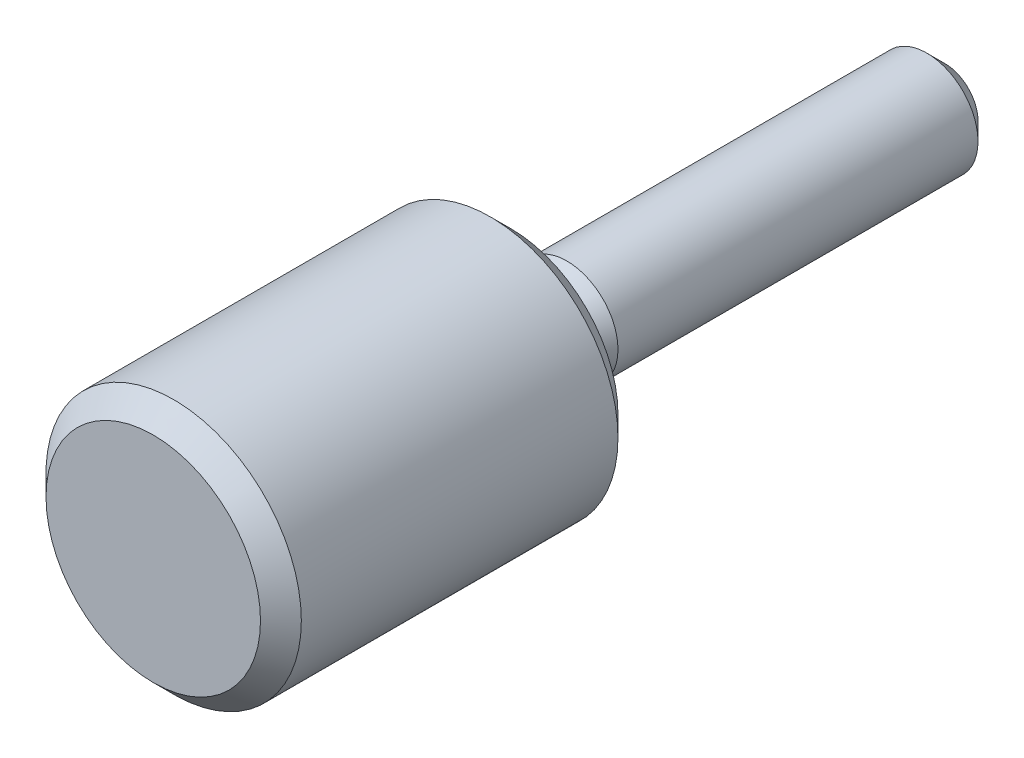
ISO-10303-21;
HEADER;
FILE_DESCRIPTION(('STEP AP214'),'2;1');
FILE_NAME('part.step','',(''),(''),'','','');
FILE_SCHEMA(('AUTOMOTIVE_DESIGN { 1 0 10303 214 1 1 1 1 }'));
ENDSEC;
DATA;
#1=APPLICATION_CONTEXT('core data for automotive mechanical design processes');
#2=APPLICATION_PROTOCOL_DEFINITION('international standard','automotive_design',2000,#1);
#3=PRODUCT_CONTEXT('',#1,'mechanical');
#4=PRODUCT('Part','Part','',(#3));
#5=PRODUCT_RELATED_PRODUCT_CATEGORY('part','',(#4));
#6=PRODUCT_DEFINITION_FORMATION('','',#4);
#7=PRODUCT_DEFINITION_CONTEXT('part definition',#1,'design');
#8=PRODUCT_DEFINITION('design','',#6,#7);
#9=PRODUCT_DEFINITION_SHAPE('','',#8);
#10=(LENGTH_UNIT() NAMED_UNIT(*) SI_UNIT(.MILLI.,.METRE.));
#11=(NAMED_UNIT(*) PLANE_ANGLE_UNIT() SI_UNIT($,.RADIAN.));
#12=(NAMED_UNIT(*) SI_UNIT($,.STERADIAN.) SOLID_ANGLE_UNIT());
#13=UNCERTAINTY_MEASURE_WITH_UNIT(LENGTH_MEASURE(1.E-05),#10,'distance_accuracy_value','');
#14=(GEOMETRIC_REPRESENTATION_CONTEXT(3) GLOBAL_UNCERTAINTY_ASSIGNED_CONTEXT((#13)) GLOBAL_UNIT_ASSIGNED_CONTEXT((#10,
#11,#12)) REPRESENTATION_CONTEXT('',''));
#15=CARTESIAN_POINT('',(0.,0.,0.));
#16=DIRECTION('',(0.,0.,1.));
#17=DIRECTION('',(1.,0.,0.));
#18=AXIS2_PLACEMENT_3D('',#15,#16,#17);
#19=CARTESIAN_POINT('',(0.,0.,14.));
#20=DIRECTION('',(0.,0.,-1.));
#21=DIRECTION('',(-1.,0.,0.));
#22=AXIS2_PLACEMENT_3D('',#19,#20,#21);
#23=CYLINDRICAL_SURFACE('',#22,5.);
#24=CARTESIAN_POINT('',(0.,0.,13.2));
#25=DIRECTION('',(0.,0.,1.));
#26=DIRECTION('',(1.,0.,0.));
#27=AXIS2_PLACEMENT_3D('',#24,#25,#26);
#28=CIRCLE('',#27,5.);
#29=CARTESIAN_POINT('',(5.,0.,13.2));
#30=VERTEX_POINT('',#29);
#31=EDGE_CURVE('E23',#30,#30,#28,.F.);
#32=ORIENTED_EDGE('',*,*,#31,.T.);
#33=EDGE_LOOP('',(#32));
#34=FACE_BOUND('',#33,.T.);
#35=CARTESIAN_POINT('',(0.,0.,0.8));
#36=DIRECTION('',(0.,0.,1.));
#37=DIRECTION('',(1.,0.,0.));
#38=AXIS2_PLACEMENT_3D('',#35,#36,#37);
#39=CIRCLE('',#38,5.);
#40=CARTESIAN_POINT('',(5.,0.,0.8));
#41=VERTEX_POINT('',#40);
#42=EDGE_CURVE('E35',#41,#41,#39,.T.);
#43=ORIENTED_EDGE('',*,*,#42,.T.);
#44=EDGE_LOOP('',(#43));
#45=FACE_BOUND('',#44,.T.);
#46=ADVANCED_FACE('F12',(#34,#45),#23,.T.);
#47=CARTESIAN_POINT('',(0.,0.,14.));
#48=DIRECTION('',(0.,0.,1.));
#49=DIRECTION('',(1.,0.,0.));
#50=AXIS2_PLACEMENT_3D('',#47,#48,#49);
#51=PLANE('',#50);
#52=CARTESIAN_POINT('',(0.,0.,14.));
#53=DIRECTION('',(0.,0.,1.));
#54=DIRECTION('',(1.,0.,0.));
#55=AXIS2_PLACEMENT_3D('',#52,#53,#54);
#56=CIRCLE('',#55,4.2);
#57=CARTESIAN_POINT('',(4.2,0.,14.));
#58=VERTEX_POINT('',#57);
#59=EDGE_CURVE('E27',#58,#58,#56,.T.);
#60=ORIENTED_EDGE('',*,*,#59,.T.);
#61=EDGE_LOOP('',(#60));
#62=FACE_BOUND('',#61,.T.);
#63=ADVANCED_FACE('F64',(#62),#51,.T.);
#64=CARTESIAN_POINT('',(0.,0.,0.));
#65=DIRECTION('',(0.,0.,1.));
#66=DIRECTION('',(1.,0.,0.));
#67=AXIS2_PLACEMENT_3D('',#64,#65,#66);
#68=PLANE('',#67);
#69=CARTESIAN_POINT('',(0.,0.,0.));
#70=DIRECTION('',(0.,0.,1.));
#71=DIRECTION('',(1.,0.,0.));
#72=AXIS2_PLACEMENT_3D('',#69,#70,#71);
#73=CIRCLE('',#72,4.2);
#74=CARTESIAN_POINT('',(4.2,0.,0.));
#75=VERTEX_POINT('',#74);
#76=EDGE_CURVE('E32',#75,#75,#73,.F.);
#77=ORIENTED_EDGE('',*,*,#76,.T.);
#78=EDGE_LOOP('',(#77));
#79=FACE_BOUND('',#78,.T.);
#80=CARTESIAN_POINT('',(0.,0.,0.));
#81=DIRECTION('',(0.,0.,1.));
#82=DIRECTION('',(1.,0.,0.));
#83=AXIS2_PLACEMENT_3D('',#80,#81,#82);
#84=CIRCLE('',#83,1.9);
#85=CARTESIAN_POINT('',(1.9,0.,0.));
#86=VERTEX_POINT('',#85);
#87=EDGE_CURVE('E44',#86,#86,#84,.T.);
#88=ORIENTED_EDGE('',*,*,#87,.T.);
#89=EDGE_LOOP('',(#88));
#90=FACE_BOUND('',#89,.T.);
#91=ADVANCED_FACE('F70',(#79,#90),#68,.F.);
#92=CARTESIAN_POINT('',(0.,0.,0.8));
#93=DIRECTION('',(0.,0.,1.));
#94=DIRECTION('',(1.,0.,0.));
#95=AXIS2_PLACEMENT_3D('',#92,#93,#94);
#96=CONICAL_SURFACE('',#95,5.,0.78539816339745);
#97=ORIENTED_EDGE('',*,*,#76,.F.);
#98=EDGE_LOOP('',(#97));
#99=FACE_BOUND('',#98,.T.);
#100=ORIENTED_EDGE('',*,*,#42,.F.);
#101=EDGE_LOOP('',(#100));
#102=FACE_BOUND('',#101,.T.);
#103=ADVANCED_FACE('F95',(#99,#102),#96,.T.);
#104=CARTESIAN_POINT('',(0.,0.,14.));
#105=DIRECTION('',(0.,0.,-1.));
#106=DIRECTION('',(-1.,0.,0.));
#107=AXIS2_PLACEMENT_3D('',#104,#105,#106);
#108=CONICAL_SURFACE('',#107,4.2,0.785398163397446);
#109=ORIENTED_EDGE('',*,*,#31,.F.);
#110=EDGE_LOOP('',(#109));
#111=FACE_BOUND('',#110,.T.);
#112=ORIENTED_EDGE('',*,*,#59,.F.);
#113=EDGE_LOOP('',(#112));
#114=FACE_BOUND('',#113,.T.);
#115=ADVANCED_FACE('F92',(#111,#114),#108,.T.);
#116=CARTESIAN_POINT('',(0.,0.,-1.21869474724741));
#117=DIRECTION('',(0.,0.,-1.));
#118=DIRECTION('',(-1.,0.,0.));
#119=AXIS2_PLACEMENT_3D('',#116,#117,#118);
#120=CONICAL_SURFACE('',#119,1.5,0.471238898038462);
#121=CARTESIAN_POINT('',(0.,0.,-2.2));
#122=DIRECTION('',(0.,0.,1.));
#123=DIRECTION('',(1.,0.,0.));
#124=AXIS2_PLACEMENT_3D('',#121,#122,#123);
#125=CIRCLE('',#124,2.);
#126=CARTESIAN_POINT('',(2.,0.,-2.2));
#127=VERTEX_POINT('',#126);
#128=EDGE_CURVE('E47',#127,#127,#125,.T.);
#129=ORIENTED_EDGE('',*,*,#128,.T.);
#130=EDGE_LOOP('',(#129));
#131=FACE_BOUND('',#130,.T.);
#132=CARTESIAN_POINT('',(0.,0.,-1.21869474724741));
#133=DIRECTION('',(0.,0.,1.));
#134=DIRECTION('',(1.,0.,0.));
#135=AXIS2_PLACEMENT_3D('',#132,#133,#134);
#136=CIRCLE('',#135,1.5);
#137=CARTESIAN_POINT('',(1.5,0.,-1.21869474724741));
#138=VERTEX_POINT('',#137);
#139=EDGE_CURVE('E38',#138,#138,#136,.T.);
#140=ORIENTED_EDGE('',*,*,#139,.F.);
#141=EDGE_LOOP('',(#140));
#142=FACE_BOUND('',#141,.T.);
#143=ADVANCED_FACE('F51',(#131,#142),#120,.T.);
#144=CARTESIAN_POINT('',(0.,0.,0.));
#145=DIRECTION('',(0.,0.,1.));
#146=DIRECTION('',(1.,0.,0.));
#147=AXIS2_PLACEMENT_3D('',#144,#145,#146);
#148=CYLINDRICAL_SURFACE('',#147,1.5);
#149=ORIENTED_EDGE('',*,*,#139,.T.);
#150=EDGE_LOOP('',(#149));
#151=FACE_BOUND('',#150,.T.);
#152=CARTESIAN_POINT('',(0.,0.,-0.4));
#153=DIRECTION('',(0.,0.,1.));
#154=DIRECTION('',(1.,0.,0.));
#155=AXIS2_PLACEMENT_3D('',#152,#153,#154);
#156=CIRCLE('',#155,1.5);
#157=CARTESIAN_POINT('',(1.5,0.,-0.4));
#158=VERTEX_POINT('',#157);
#159=EDGE_CURVE('E41',#158,#158,#156,.T.);
#160=ORIENTED_EDGE('',*,*,#159,.F.);
#161=EDGE_LOOP('',(#160));
#162=FACE_BOUND('',#161,.T.);
#163=ADVANCED_FACE('F80',(#151,#162),#148,.T.);
#164=CARTESIAN_POINT('',(0.,0.,-0.4));
#165=DIRECTION('',(0.,0.,1.));
#166=DIRECTION('',(1.,0.,0.));
#167=AXIS2_PLACEMENT_3D('',#164,#165,#166);
#168=TOROIDAL_SURFACE('',#167,1.9,0.4);
#169=ORIENTED_EDGE('',*,*,#159,.T.);
#170=EDGE_LOOP('',(#169));
#171=FACE_BOUND('',#170,.T.);
#172=ORIENTED_EDGE('',*,*,#87,.F.);
#173=EDGE_LOOP('',(#172));
#174=FACE_BOUND('',#173,.T.);
#175=ADVANCED_FACE('F76',(#171,#174),#168,.F.);
#176=CARTESIAN_POINT('',(0.,0.,-17.));
#177=DIRECTION('',(0.,0.,1.));
#178=DIRECTION('',(1.,0.,0.));
#179=AXIS2_PLACEMENT_3D('',#176,#177,#178);
#180=PLANE('',#179);
#181=CARTESIAN_POINT('',(0.,0.,-17.));
#182=DIRECTION('',(0.,0.,1.));
#183=DIRECTION('',(1.,0.,0.));
#184=AXIS2_PLACEMENT_3D('',#181,#182,#183);
#185=CIRCLE('',#184,1.3);
#186=CARTESIAN_POINT('',(1.3,0.,-17.));
#187=VERTEX_POINT('',#186);
#188=EDGE_CURVE('E19',#187,#187,#185,.F.);
#189=ORIENTED_EDGE('',*,*,#188,.T.);
#190=EDGE_LOOP('',(#189));
#191=FACE_BOUND('',#190,.T.);
#192=ADVANCED_FACE('F60',(#191),#180,.F.);
#193=CARTESIAN_POINT('',(0.,0.,-17.));
#194=DIRECTION('',(0.,0.,1.));
#195=DIRECTION('',(1.,0.,0.));
#196=AXIS2_PLACEMENT_3D('',#193,#194,#195);
#197=CONICAL_SURFACE('',#196,1.3,0.785398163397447);
#198=CARTESIAN_POINT('',(0.,0.,-16.3));
#199=DIRECTION('',(0.,0.,1.));
#200=DIRECTION('',(1.,0.,0.));
#201=AXIS2_PLACEMENT_3D('',#198,#199,#200);
#202=CIRCLE('',#201,2.);
#203=CARTESIAN_POINT('',(2.,0.,-16.3));
#204=VERTEX_POINT('',#203);
#205=EDGE_CURVE('E8',#204,#204,#202,.T.);
#206=ORIENTED_EDGE('',*,*,#205,.F.);
#207=EDGE_LOOP('',(#206));
#208=FACE_BOUND('',#207,.T.);
#209=ORIENTED_EDGE('',*,*,#188,.F.);
#210=EDGE_LOOP('',(#209));
#211=FACE_BOUND('',#210,.T.);
#212=ADVANCED_FACE('F14',(#208,#211),#197,.T.);
#213=CARTESIAN_POINT('',(0.,0.,8.));
#214=DIRECTION('',(0.,0.,-1.));
#215=DIRECTION('',(-1.,0.,0.));
#216=AXIS2_PLACEMENT_3D('',#213,#214,#215);
#217=CYLINDRICAL_SURFACE('',#216,2.);
#218=ORIENTED_EDGE('',*,*,#205,.T.);
#219=EDGE_LOOP('',(#218));
#220=FACE_BOUND('',#219,.T.);
#221=ORIENTED_EDGE('',*,*,#128,.F.);
#222=EDGE_LOOP('',(#221));
#223=FACE_BOUND('',#222,.T.);
#224=ADVANCED_FACE('F54',(#220,#223),#217,.T.);
#225=CLOSED_SHELL('',(#46,#63,#91,#103,#115,#143,#163,#175,#192,#212,#224));
#226=MANIFOLD_SOLID_BREP('B1',#225);
#227=ADVANCED_BREP_SHAPE_REPRESENTATION('',(#18,#226),#14);
#228=SHAPE_DEFINITION_REPRESENTATION(#9,#227);
ENDSEC;
END-ISO-10303-21;
